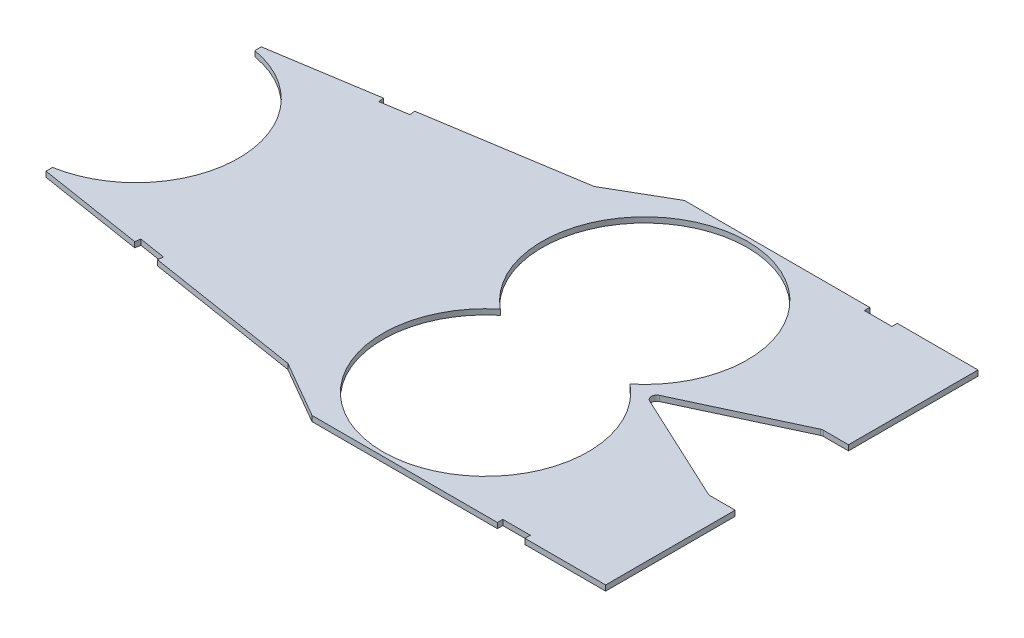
ISO-10303-21;
HEADER;
FILE_DESCRIPTION(('STEP AP214'),'2;1');
FILE_NAME('part.step','',(''),(''),'','','');
FILE_SCHEMA(('AUTOMOTIVE_DESIGN { 1 0 10303 214 1 1 1 1 }'));
ENDSEC;
DATA;
#1=APPLICATION_CONTEXT('core data for automotive mechanical design processes');
#2=APPLICATION_PROTOCOL_DEFINITION('international standard','automotive_design',2000,#1);
#3=PRODUCT_CONTEXT('',#1,'mechanical');
#4=PRODUCT('Part','Part','',(#3));
#5=PRODUCT_RELATED_PRODUCT_CATEGORY('part','',(#4));
#6=PRODUCT_DEFINITION_FORMATION('','',#4);
#7=PRODUCT_DEFINITION_CONTEXT('part definition',#1,'design');
#8=PRODUCT_DEFINITION('design','',#6,#7);
#9=PRODUCT_DEFINITION_SHAPE('','',#8);
#10=(LENGTH_UNIT() NAMED_UNIT(*) SI_UNIT(.MILLI.,.METRE.));
#11=(NAMED_UNIT(*) PLANE_ANGLE_UNIT() SI_UNIT($,.RADIAN.));
#12=(NAMED_UNIT(*) SI_UNIT($,.STERADIAN.) SOLID_ANGLE_UNIT());
#13=UNCERTAINTY_MEASURE_WITH_UNIT(LENGTH_MEASURE(1.E-05),#10,'distance_accuracy_value','');
#14=(GEOMETRIC_REPRESENTATION_CONTEXT(3) GLOBAL_UNCERTAINTY_ASSIGNED_CONTEXT((#13)) GLOBAL_UNIT_ASSIGNED_CONTEXT((#10,
#11,#12)) REPRESENTATION_CONTEXT('',''));
#15=CARTESIAN_POINT('',(0.,0.,0.));
#16=DIRECTION('',(0.,0.,1.));
#17=DIRECTION('',(1.,0.,0.));
#18=AXIS2_PLACEMENT_3D('',#15,#16,#17);
#19=CARTESIAN_POINT('',(-9.3,2.,19.));
#20=DIRECTION('',(0.,1.,0.));
#21=DIRECTION('',(0.,0.,1.));
#22=AXIS2_PLACEMENT_3D('',#19,#20,#21);
#23=CYLINDRICAL_SURFACE('',#22,2.);
#24=CARTESIAN_POINT('',(-9.3,2.,19.));
#25=DIRECTION('',(0.,1.,0.));
#26=DIRECTION('',(0.,0.,1.));
#27=AXIS2_PLACEMENT_3D('',#24,#25,#26);
#28=CIRCLE('',#27,2.);
#29=CARTESIAN_POINT('',(-9.3,2.,21.));
#30=VERTEX_POINT('',#29);
#31=CARTESIAN_POINT('',(-10.1452365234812,2.,20.8126155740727));
#32=VERTEX_POINT('',#31);
#33=EDGE_CURVE('E575',#30,#32,#28,.F.);
#34=ORIENTED_EDGE('',*,*,#33,.F.);
#35=DIRECTION('',(0.,1.,0.));
#36=VECTOR('',#35,1.);
#37=CARTESIAN_POINT('',(-9.3,2.,21.));
#38=LINE('',#37,#36);
#39=CARTESIAN_POINT('',(-9.3,0.,21.));
#40=VERTEX_POINT('',#39);
#41=EDGE_CURVE('E317',#30,#40,#38,.F.);
#42=ORIENTED_EDGE('',*,*,#41,.T.);
#43=CARTESIAN_POINT('',(-9.3,0.,19.));
#44=DIRECTION('',(0.,1.,0.));
#45=DIRECTION('',(0.,0.,1.));
#46=AXIS2_PLACEMENT_3D('',#43,#44,#45);
#47=CIRCLE('',#46,2.);
#48=CARTESIAN_POINT('',(-10.1452365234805,0.,20.8126155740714));
#49=VERTEX_POINT('',#48);
#50=EDGE_CURVE('E19',#49,#40,#47,.T.);
#51=ORIENTED_EDGE('',*,*,#50,.F.);
#52=DIRECTION('',(0.,1.,0.));
#53=VECTOR('',#52,1.);
#54=CARTESIAN_POINT('',(-10.1452365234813,2.,20.8126155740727));
#55=LINE('',#54,#53);
#56=EDGE_CURVE('E315',#49,#32,#55,.T.);
#57=ORIENTED_EDGE('',*,*,#56,.T.);
#58=EDGE_LOOP('',(#34,#42,#51,#57));
#59=FACE_BOUND('',#58,.T.);
#60=ADVANCED_FACE('F16',(#59),#23,.F.);
#61=CARTESIAN_POINT('',(-9.3,2.,-19.));
#62=DIRECTION('',(0.,1.,0.));
#63=DIRECTION('',(0.,0.,1.));
#64=AXIS2_PLACEMENT_3D('',#61,#62,#63);
#65=CYLINDRICAL_SURFACE('',#64,2.);
#66=CARTESIAN_POINT('',(-9.3,2.,-19.));
#67=DIRECTION('',(0.,1.,0.));
#68=DIRECTION('',(0.,0.,1.));
#69=AXIS2_PLACEMENT_3D('',#66,#67,#68);
#70=CIRCLE('',#69,2.);
#71=CARTESIAN_POINT('',(-10.1452365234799,2.,-20.81261557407));
#72=VERTEX_POINT('',#71);
#73=CARTESIAN_POINT('',(-9.3,2.,-21.));
#74=VERTEX_POINT('',#73);
#75=EDGE_CURVE('E284',#72,#74,#70,.F.);
#76=ORIENTED_EDGE('',*,*,#75,.F.);
#77=DIRECTION('',(0.,1.,0.));
#78=VECTOR('',#77,1.);
#79=CARTESIAN_POINT('',(-10.14523652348,2.,-20.81261557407));
#80=LINE('',#79,#78);
#81=CARTESIAN_POINT('',(-10.1452365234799,0.,-20.81261557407));
#82=VERTEX_POINT('',#81);
#83=EDGE_CURVE('E303',#72,#82,#80,.F.);
#84=ORIENTED_EDGE('',*,*,#83,.T.);
#85=CARTESIAN_POINT('',(-9.3,0.,-19.));
#86=DIRECTION('',(0.,1.,0.));
#87=DIRECTION('',(0.,0.,1.));
#88=AXIS2_PLACEMENT_3D('',#85,#86,#87);
#89=CIRCLE('',#88,2.);
#90=CARTESIAN_POINT('',(-9.3,0.,-21.));
#91=VERTEX_POINT('',#90);
#92=EDGE_CURVE('E576',#91,#82,#89,.T.);
#93=ORIENTED_EDGE('',*,*,#92,.F.);
#94=DIRECTION('',(0.,1.,0.));
#95=VECTOR('',#94,1.);
#96=CARTESIAN_POINT('',(-9.3,2.,-21.));
#97=LINE('',#96,#95);
#98=EDGE_CURVE('E288',#91,#74,#97,.T.);
#99=ORIENTED_EDGE('',*,*,#98,.T.);
#100=EDGE_LOOP('',(#76,#84,#93,#99));
#101=FACE_BOUND('',#100,.T.);
#102=ADVANCED_FACE('F584',(#101),#65,.F.);
#103=CARTESIAN_POINT('',(0.,2.,0.));
#104=DIRECTION('',(0.,1.,0.));
#105=DIRECTION('',(0.,0.,1.));
#106=AXIS2_PLACEMENT_3D('',#103,#104,#105);
#107=PLANE('',#106);
#108=CARTESIAN_POINT('',(-84.,2.,-29.5));
#109=DIRECTION('',(0.,1.,0.));
#110=DIRECTION('',(0.,0.,1.));
#111=AXIS2_PLACEMENT_3D('',#108,#109,#110);
#112=CIRCLE('',#111,38.05);
#113=CARTESIAN_POINT('',(-108.032321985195,2.,-1.66880398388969E-12));
#114=VERTEX_POINT('',#113);
#115=CARTESIAN_POINT('',(-59.9676780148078,2.,7.84095011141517E-13));
#116=VERTEX_POINT('',#115);
#117=EDGE_CURVE('E566',#114,#116,#112,.F.);
#118=ORIENTED_EDGE('',*,*,#117,.T.);
#119=CARTESIAN_POINT('',(-84.,2.,29.5));
#120=DIRECTION('',(0.,1.,0.));
#121=DIRECTION('',(0.,0.,1.));
#122=AXIS2_PLACEMENT_3D('',#119,#120,#121);
#123=CIRCLE('',#122,38.05);
#124=EDGE_CURVE('E415',#116,#114,#123,.F.);
#125=ORIENTED_EDGE('',*,*,#124,.T.);
#126=EDGE_LOOP('',(#118,#125));
#127=FACE_BOUND('',#126,.T.);
#128=DIRECTION('',(-0.987688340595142,0.,-0.156434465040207));
#129=VECTOR('',#128,1.);
#130=CARTESIAN_POINT('',(-187.1484049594,2.,45.68382590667));
#131=LINE('',#130,#129);
#132=CARTESIAN_POINT('',(-197.1240571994,2.,44.1038378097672));
#133=VERTEX_POINT('',#132);
#134=CARTESIAN_POINT('',(-187.148404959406,2.,45.683825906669));
#135=VERTEX_POINT('',#134);
#136=EDGE_CURVE('E416',#133,#135,#131,.F.);
#137=ORIENTED_EDGE('',*,*,#136,.T.);
#138=DIRECTION('',(0.156434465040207,0.,-0.987688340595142));
#139=VECTOR('',#138,1.);
#140=CARTESIAN_POINT('',(-187.4612738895,2.,47.65920258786));
#141=LINE('',#140,#139);
#142=CARTESIAN_POINT('',(-187.4612738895,2.,47.659202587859));
#143=VERTEX_POINT('',#142);
#144=EDGE_CURVE('E172',#135,#143,#141,.F.);
#145=ORIENTED_EDGE('',*,*,#144,.T.);
#146=DIRECTION('',(0.987688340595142,0.,0.156434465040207));
#147=VECTOR('',#146,1.);
#148=CARTESIAN_POINT('',(-236.5,2.,39.89223139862));
#149=LINE('',#148,#147);
#150=CARTESIAN_POINT('',(-130.,2.,56.7601742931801));
#151=VERTEX_POINT('',#150);
#152=EDGE_CURVE('E405',#151,#143,#149,.F.);
#153=ORIENTED_EDGE('',*,*,#152,.F.);
#154=DIRECTION('',(0.866025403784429,0.,0.500000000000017));
#155=VECTOR('',#154,1.);
#156=CARTESIAN_POINT('',(-130.,2.,56.76017429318));
#157=LINE('',#156,#155);
#158=CARTESIAN_POINT('',(-108.8,2.,69.0000000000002));
#159=VERTEX_POINT('',#158);
#160=EDGE_CURVE('E395',#159,#151,#157,.F.);
#161=ORIENTED_EDGE('',*,*,#160,.F.);
#162=DIRECTION('',(1.,0.,0.));
#163=VECTOR('',#162,1.);
#164=CARTESIAN_POINT('',(-108.8,2.,69.));
#165=LINE('',#164,#163);
#166=CARTESIAN_POINT('',(-40.1,2.,69.));
#167=VERTEX_POINT('',#166);
#168=EDGE_CURVE('E385',#167,#159,#165,.F.);
#169=ORIENTED_EDGE('',*,*,#168,.F.);
#170=DIRECTION('',(0.,0.,1.));
#171=VECTOR('',#170,1.);
#172=CARTESIAN_POINT('',(-40.1,2.,67.));
#173=LINE('',#172,#171);
#174=CARTESIAN_POINT('',(-40.1,2.,67.));
#175=VERTEX_POINT('',#174);
#176=EDGE_CURVE('E365',#167,#175,#173,.F.);
#177=ORIENTED_EDGE('',*,*,#176,.T.);
#178=DIRECTION('',(-1.,0.,0.));
#179=VECTOR('',#178,1.);
#180=CARTESIAN_POINT('',(-29.9,2.,67.));
#181=LINE('',#180,#179);
#182=CARTESIAN_POINT('',(-29.9,2.,67.));
#183=VERTEX_POINT('',#182);
#184=EDGE_CURVE('E354',#175,#183,#181,.F.);
#185=ORIENTED_EDGE('',*,*,#184,.T.);
#186=DIRECTION('',(0.,0.,-1.));
#187=VECTOR('',#186,1.);
#188=CARTESIAN_POINT('',(-29.9,2.,69.));
#189=LINE('',#188,#187);
#190=CARTESIAN_POINT('',(-29.9,2.,69.));
#191=VERTEX_POINT('',#190);
#192=EDGE_CURVE('E353',#183,#191,#189,.F.);
#193=ORIENTED_EDGE('',*,*,#192,.T.);
#194=DIRECTION('',(1.,0.,0.));
#195=VECTOR('',#194,1.);
#196=CARTESIAN_POINT('',(-108.8,2.,69.));
#197=LINE('',#196,#195);
#198=CARTESIAN_POINT('',(0.,2.,69.));
#199=VERTEX_POINT('',#198);
#200=EDGE_CURVE('E342',#199,#191,#197,.F.);
#201=ORIENTED_EDGE('',*,*,#200,.F.);
#202=DIRECTION('',(0.,0.,-1.));
#203=VECTOR('',#202,1.);
#204=CARTESIAN_POINT('',(0.,2.,69.));
#205=LINE('',#204,#203);
#206=CARTESIAN_POINT('',(0.,2.,21.));
#207=VERTEX_POINT('',#206);
#208=EDGE_CURVE('E332',#207,#199,#205,.F.);
#209=ORIENTED_EDGE('',*,*,#208,.F.);
#210=DIRECTION('',(1.,0.,0.));
#211=VECTOR('',#210,1.);
#212=CARTESIAN_POINT('',(-9.3,2.,21.));
#213=LINE('',#212,#211);
#214=EDGE_CURVE('E319',#207,#30,#213,.F.);
#215=ORIENTED_EDGE('',*,*,#214,.T.);
#216=ORIENTED_EDGE('',*,*,#33,.T.);
#217=DIRECTION('',(0.906307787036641,0.,0.422618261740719));
#218=VECTOR('',#217,1.);
#219=CARTESIAN_POINT('',(-50.89086801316,2.,1.812615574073));
#220=LINE('',#219,#218);
#221=CARTESIAN_POINT('',(-50.8908680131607,2.,1.81261557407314));
#222=VERTEX_POINT('',#221);
#223=EDGE_CURVE('E314',#32,#222,#220,.F.);
#224=ORIENTED_EDGE('',*,*,#223,.T.);
#225=CARTESIAN_POINT('',(-50.04563148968,2.,0.));
#226=DIRECTION('',(0.,1.,0.));
#227=DIRECTION('',(0.,0.,1.));
#228=AXIS2_PLACEMENT_3D('',#225,#226,#227);
#229=CIRCLE('',#228,2.);
#230=CARTESIAN_POINT('',(-50.89086801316,2.,-1.81261557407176));
#231=VERTEX_POINT('',#230);
#232=EDGE_CURVE('E308',#222,#231,#229,.F.);
#233=ORIENTED_EDGE('',*,*,#232,.T.);
#234=DIRECTION('',(-0.906307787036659,0.,0.422618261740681));
#235=VECTOR('',#234,1.);
#236=CARTESIAN_POINT('',(-10.14523652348,2.,-20.81261557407));
#237=LINE('',#236,#235);
#238=EDGE_CURVE('E307',#231,#72,#237,.F.);
#239=ORIENTED_EDGE('',*,*,#238,.T.);
#240=ORIENTED_EDGE('',*,*,#75,.T.);
#241=DIRECTION('',(-1.,0.,0.));
#242=VECTOR('',#241,1.);
#243=CARTESIAN_POINT('',(0.,2.,-21.));
#244=LINE('',#243,#242);
#245=CARTESIAN_POINT('',(0.,2.,-21.));
#246=VERTEX_POINT('',#245);
#247=EDGE_CURVE('E279',#74,#246,#244,.F.);
#248=ORIENTED_EDGE('',*,*,#247,.T.);
#249=DIRECTION('',(0.,0.,-1.));
#250=VECTOR('',#249,1.);
#251=CARTESIAN_POINT('',(0.,2.,69.));
#252=LINE('',#251,#250);
#253=CARTESIAN_POINT('',(0.,2.,-69.));
#254=VERTEX_POINT('',#253);
#255=EDGE_CURVE('E271',#254,#246,#252,.F.);
#256=ORIENTED_EDGE('',*,*,#255,.F.);
#257=DIRECTION('',(-1.,0.,0.));
#258=VECTOR('',#257,1.);
#259=CARTESIAN_POINT('',(0.,2.,-69.));
#260=LINE('',#259,#258);
#261=CARTESIAN_POINT('',(-29.9,2.,-69.));
#262=VERTEX_POINT('',#261);
#263=EDGE_CURVE('E266',#262,#254,#260,.F.);
#264=ORIENTED_EDGE('',*,*,#263,.F.);
#265=DIRECTION('',(0.,0.,-1.));
#266=VECTOR('',#265,1.);
#267=CARTESIAN_POINT('',(-29.9,2.,-67.));
#268=LINE('',#267,#266);
#269=CARTESIAN_POINT('',(-29.9,2.,-67.));
#270=VERTEX_POINT('',#269);
#271=EDGE_CURVE('E512',#262,#270,#268,.F.);
#272=ORIENTED_EDGE('',*,*,#271,.T.);
#273=DIRECTION('',(1.,0.,0.));
#274=VECTOR('',#273,1.);
#275=CARTESIAN_POINT('',(-40.1,2.,-67.));
#276=LINE('',#275,#274);
#277=CARTESIAN_POINT('',(-40.1,2.,-67.));
#278=VERTEX_POINT('',#277);
#279=EDGE_CURVE('E507',#270,#278,#276,.F.);
#280=ORIENTED_EDGE('',*,*,#279,.T.);
#281=DIRECTION('',(0.,0.,1.));
#282=VECTOR('',#281,1.);
#283=CARTESIAN_POINT('',(-40.1,2.,-69.));
#284=LINE('',#283,#282);
#285=CARTESIAN_POINT('',(-40.1,2.,-69.));
#286=VERTEX_POINT('',#285);
#287=EDGE_CURVE('E499',#278,#286,#284,.F.);
#288=ORIENTED_EDGE('',*,*,#287,.T.);
#289=DIRECTION('',(-1.,0.,0.));
#290=VECTOR('',#289,1.);
#291=CARTESIAN_POINT('',(0.,2.,-69.));
#292=LINE('',#291,#290);
#293=CARTESIAN_POINT('',(-108.8,2.,-69.));
#294=VERTEX_POINT('',#293);
#295=EDGE_CURVE('E497',#294,#286,#292,.F.);
#296=ORIENTED_EDGE('',*,*,#295,.F.);
#297=DIRECTION('',(-0.866025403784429,0.,0.500000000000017));
#298=VECTOR('',#297,1.);
#299=CARTESIAN_POINT('',(-108.8,2.,-69.));
#300=LINE('',#299,#298);
#301=CARTESIAN_POINT('',(-130.,2.,-56.7601742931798));
#302=VERTEX_POINT('',#301);
#303=EDGE_CURVE('E492',#302,#294,#300,.F.);
#304=ORIENTED_EDGE('',*,*,#303,.F.);
#305=DIRECTION('',(-0.987688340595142,0.,0.156434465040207));
#306=VECTOR('',#305,1.);
#307=CARTESIAN_POINT('',(-130.,2.,-56.76017429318));
#308=LINE('',#307,#306);
#309=CARTESIAN_POINT('',(-187.461273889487,2.,-47.6592025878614));
#310=VERTEX_POINT('',#309);
#311=EDGE_CURVE('E486',#310,#302,#308,.F.);
#312=ORIENTED_EDGE('',*,*,#311,.F.);
#313=DIRECTION('',(-0.156434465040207,0.,-0.987688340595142));
#314=VECTOR('',#313,1.);
#315=CARTESIAN_POINT('',(-187.1484049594,2.,-45.68382590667));
#316=LINE('',#315,#314);
#317=CARTESIAN_POINT('',(-187.1484049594,2.,-45.6838259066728));
#318=VERTEX_POINT('',#317);
#319=EDGE_CURVE('E481',#310,#318,#316,.F.);
#320=ORIENTED_EDGE('',*,*,#319,.T.);
#321=DIRECTION('',(0.987688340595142,0.,-0.156434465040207));
#322=VECTOR('',#321,1.);
#323=CARTESIAN_POINT('',(-197.1240571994,2.,-44.10383780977));
#324=LINE('',#323,#322);
#325=CARTESIAN_POINT('',(-197.124057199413,2.,-44.103837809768));
#326=VERTEX_POINT('',#325);
#327=EDGE_CURVE('E476',#318,#326,#324,.F.);
#328=ORIENTED_EDGE('',*,*,#327,.T.);
#329=DIRECTION('',(0.156434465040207,0.,0.987688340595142));
#330=VECTOR('',#329,1.);
#331=CARTESIAN_POINT('',(-197.4369261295,2.,-46.07921449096));
#332=LINE('',#331,#330);
#333=CARTESIAN_POINT('',(-197.436926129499,2.,-46.0792144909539));
#334=VERTEX_POINT('',#333);
#335=EDGE_CURVE('E468',#326,#334,#332,.F.);
#336=ORIENTED_EDGE('',*,*,#335,.T.);
#337=DIRECTION('',(-0.987688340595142,0.,0.156434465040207));
#338=VECTOR('',#337,1.);
#339=CARTESIAN_POINT('',(-130.,2.,-56.76017429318));
#340=LINE('',#339,#338);
#341=CARTESIAN_POINT('',(-236.5,2.,-39.8922313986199));
#342=VERTEX_POINT('',#341);
#343=EDGE_CURVE('E466',#342,#334,#340,.F.);
#344=ORIENTED_EDGE('',*,*,#343,.F.);
#345=DIRECTION('',(0.,0.,1.));
#346=VECTOR('',#345,1.);
#347=CARTESIAN_POINT('',(-236.5,2.,-39.89223139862));
#348=LINE('',#347,#346);
#349=CARTESIAN_POINT('',(-236.5,2.,-37.4906988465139));
#350=VERTEX_POINT('',#349);
#351=EDGE_CURVE('E460',#350,#342,#348,.F.);
#352=ORIENTED_EDGE('',*,*,#351,.F.);
#353=CARTESIAN_POINT('',(-243.,2.,0.));
#354=DIRECTION('',(0.,1.,0.));
#355=DIRECTION('',(0.,0.,1.));
#356=AXIS2_PLACEMENT_3D('',#353,#354,#355);
#357=CIRCLE('',#356,38.05);
#358=CARTESIAN_POINT('',(-236.5,2.,37.490698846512));
#359=VERTEX_POINT('',#358);
#360=EDGE_CURVE('E457',#350,#359,#357,.F.);
#361=ORIENTED_EDGE('',*,*,#360,.T.);
#362=DIRECTION('',(0.,0.,1.));
#363=VECTOR('',#362,1.);
#364=CARTESIAN_POINT('',(-236.5,2.,37.49069884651));
#365=LINE('',#364,#363);
#366=CARTESIAN_POINT('',(-236.5,2.,39.89223139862));
#367=VERTEX_POINT('',#366);
#368=EDGE_CURVE('E455',#367,#359,#365,.F.);
#369=ORIENTED_EDGE('',*,*,#368,.F.);
#370=DIRECTION('',(0.987688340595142,0.,0.156434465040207));
#371=VECTOR('',#370,1.);
#372=CARTESIAN_POINT('',(-236.5,2.,39.89223139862));
#373=LINE('',#372,#371);
#374=CARTESIAN_POINT('',(-197.436926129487,2.,46.0792144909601));
#375=VERTEX_POINT('',#374);
#376=EDGE_CURVE('E450',#375,#367,#373,.F.);
#377=ORIENTED_EDGE('',*,*,#376,.F.);
#378=DIRECTION('',(-0.156434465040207,0.,0.987688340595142));
#379=VECTOR('',#378,1.);
#380=CARTESIAN_POINT('',(-197.1240571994,2.,44.10383780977));
#381=LINE('',#380,#379);
#382=EDGE_CURVE('E181',#375,#133,#381,.F.);
#383=ORIENTED_EDGE('',*,*,#382,.T.);
#384=EDGE_LOOP('',(#137,#145,#153,#161,#169,#177,#185,#193,#201,#209,#215,#216,#224,#233,#239,
#240,#248,#256,#264,#272,#280,#288,#296,#304,#312,#320,#328,#336,#344,#352,#361,#369,#377,#383));
#385=FACE_BOUND('',#384,.T.);
#386=ADVANCED_FACE('F282',(#127,#385),#107,.T.);
#387=CARTESIAN_POINT('',(-187.4612738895,2.,47.65920258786));
#388=DIRECTION('',(0.987688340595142,0.,0.156434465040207));
#389=DIRECTION('',(0.156434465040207,0.,-0.987688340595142));
#390=AXIS2_PLACEMENT_3D('',#387,#388,#389);
#391=PLANE('',#390);
#392=ORIENTED_EDGE('',*,*,#144,.F.);
#393=DIRECTION('',(0.,1.,0.));
#394=VECTOR('',#393,1.);
#395=CARTESIAN_POINT('',(-187.1484049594,2.,45.68382590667));
#396=LINE('',#395,#394);
#397=CARTESIAN_POINT('',(-187.1484049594,0.,45.68382590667));
#398=VERTEX_POINT('',#397);
#399=EDGE_CURVE('E413',#135,#398,#396,.F.);
#400=ORIENTED_EDGE('',*,*,#399,.T.);
#401=DIRECTION('',(-0.156434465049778,0.,0.987688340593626));
#402=VECTOR('',#401,1.);
#403=CARTESIAN_POINT('',(-187.1484049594,0.,45.68382590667));
#404=LINE('',#403,#402);
#405=CARTESIAN_POINT('',(-187.4612738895,0.,47.6592025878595));
#406=VERTEX_POINT('',#405);
#407=EDGE_CURVE('E400',#398,#406,#404,.T.);
#408=ORIENTED_EDGE('',*,*,#407,.T.);
#409=DIRECTION('',(0.,1.,0.));
#410=VECTOR('',#409,1.);
#411=CARTESIAN_POINT('',(-187.4612738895,0.,47.6592025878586));
#412=LINE('',#411,#410);
#413=EDGE_CURVE('E403',#143,#406,#412,.F.);
#414=ORIENTED_EDGE('',*,*,#413,.F.);
#415=EDGE_LOOP('',(#392,#400,#408,#414));
#416=FACE_BOUND('',#415,.T.);
#417=ADVANCED_FACE('F786',(#416),#391,.F.);
#418=CARTESIAN_POINT('',(-236.5,0.,39.89223139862));
#419=DIRECTION('',(-0.156434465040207,0.,0.987688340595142));
#420=DIRECTION('',(0.987688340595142,0.,0.156434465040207));
#421=AXIS2_PLACEMENT_3D('',#418,#419,#420);
#422=PLANE('',#421);
#423=ORIENTED_EDGE('',*,*,#152,.T.);
#424=ORIENTED_EDGE('',*,*,#413,.T.);
#425=DIRECTION('',(0.987688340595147,0.,0.156434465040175));
#426=VECTOR('',#425,1.);
#427=CARTESIAN_POINT('',(-187.4612738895,0.,47.65920258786));
#428=LINE('',#427,#426);
#429=CARTESIAN_POINT('',(-130.,0.,56.76017429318));
#430=VERTEX_POINT('',#429);
#431=EDGE_CURVE('E390',#406,#430,#428,.T.);
#432=ORIENTED_EDGE('',*,*,#431,.T.);
#433=DIRECTION('',(0.,1.,0.));
#434=VECTOR('',#433,1.);
#435=CARTESIAN_POINT('',(-130.,0.,56.76017429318));
#436=LINE('',#435,#434);
#437=EDGE_CURVE('E393',#151,#430,#436,.F.);
#438=ORIENTED_EDGE('',*,*,#437,.F.);
#439=EDGE_LOOP('',(#423,#424,#432,#438));
#440=FACE_BOUND('',#439,.T.);
#441=ADVANCED_FACE('F791',(#440),#422,.T.);
#442=CARTESIAN_POINT('',(-130.,0.,56.76017429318));
#443=DIRECTION('',(-0.500000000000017,0.,0.866025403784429));
#444=DIRECTION('',(0.866025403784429,0.,0.500000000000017));
#445=AXIS2_PLACEMENT_3D('',#442,#443,#444);
#446=PLANE('',#445);
#447=ORIENTED_EDGE('',*,*,#437,.T.);
#448=DIRECTION('',(0.86602540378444,0.,0.499999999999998));
#449=VECTOR('',#448,1.);
#450=CARTESIAN_POINT('',(-130.,0.,56.76017429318));
#451=LINE('',#450,#449);
#452=CARTESIAN_POINT('',(-108.8,0.,69.));
#453=VERTEX_POINT('',#452);
#454=EDGE_CURVE('E381',#430,#453,#451,.T.);
#455=ORIENTED_EDGE('',*,*,#454,.T.);
#456=DIRECTION('',(0.,1.,0.));
#457=VECTOR('',#456,1.);
#458=CARTESIAN_POINT('',(-108.8,0.,69.));
#459=LINE('',#458,#457);
#460=EDGE_CURVE('E376',#159,#453,#459,.F.);
#461=ORIENTED_EDGE('',*,*,#460,.F.);
#462=ORIENTED_EDGE('',*,*,#160,.T.);
#463=EDGE_LOOP('',(#447,#455,#461,#462));
#464=FACE_BOUND('',#463,.T.);
#465=ADVANCED_FACE('F793',(#464),#446,.T.);
#466=CARTESIAN_POINT('',(-108.8,0.,69.));
#467=DIRECTION('',(0.,0.,1.));
#468=DIRECTION('',(1.,0.,0.));
#469=AXIS2_PLACEMENT_3D('',#466,#467,#468);
#470=PLANE('',#469);
#471=DIRECTION('',(1.,0.,0.));
#472=VECTOR('',#471,1.);
#473=CARTESIAN_POINT('',(0.,0.,69.));
#474=LINE('',#473,#472);
#475=CARTESIAN_POINT('',(-40.1,0.,69.));
#476=VERTEX_POINT('',#475);
#477=EDGE_CURVE('E370',#453,#476,#474,.T.);
#478=ORIENTED_EDGE('',*,*,#477,.T.);
#479=DIRECTION('',(0.,1.,0.));
#480=VECTOR('',#479,1.);
#481=CARTESIAN_POINT('',(-40.1,2.,69.));
#482=LINE('',#481,#480);
#483=EDGE_CURVE('E373',#476,#167,#482,.T.);
#484=ORIENTED_EDGE('',*,*,#483,.T.);
#485=ORIENTED_EDGE('',*,*,#168,.T.);
#486=ORIENTED_EDGE('',*,*,#460,.T.);
#487=EDGE_LOOP('',(#478,#484,#485,#486));
#488=FACE_BOUND('',#487,.T.);
#489=ADVANCED_FACE('F799',(#488),#470,.T.);
#490=CARTESIAN_POINT('',(-40.1,2.,67.));
#491=DIRECTION('',(-1.,0.,0.));
#492=DIRECTION('',(0.,0.,1.));
#493=AXIS2_PLACEMENT_3D('',#490,#491,#492);
#494=PLANE('',#493);
#495=ORIENTED_EDGE('',*,*,#176,.F.);
#496=ORIENTED_EDGE('',*,*,#483,.F.);
#497=DIRECTION('',(0.,0.,1.));
#498=VECTOR('',#497,1.);
#499=CARTESIAN_POINT('',(-40.1,0.,0.));
#500=LINE('',#499,#498);
#501=CARTESIAN_POINT('',(-40.1,0.,67.));
#502=VERTEX_POINT('',#501);
#503=EDGE_CURVE('E359',#476,#502,#500,.F.);
#504=ORIENTED_EDGE('',*,*,#503,.T.);
#505=DIRECTION('',(0.,1.,0.));
#506=VECTOR('',#505,1.);
#507=CARTESIAN_POINT('',(-40.1,2.,67.));
#508=LINE('',#507,#506);
#509=EDGE_CURVE('E362',#502,#175,#508,.T.);
#510=ORIENTED_EDGE('',*,*,#509,.T.);
#511=EDGE_LOOP('',(#495,#496,#504,#510));
#512=FACE_BOUND('',#511,.T.);
#513=ADVANCED_FACE('F803',(#512),#494,.F.);
#514=CARTESIAN_POINT('',(-29.9,2.,67.));
#515=DIRECTION('',(0.,0.,-1.));
#516=DIRECTION('',(-1.,0.,0.));
#517=AXIS2_PLACEMENT_3D('',#514,#515,#516);
#518=PLANE('',#517);
#519=ORIENTED_EDGE('',*,*,#184,.F.);
#520=ORIENTED_EDGE('',*,*,#509,.F.);
#521=DIRECTION('',(1.,0.,0.));
#522=VECTOR('',#521,1.);
#523=CARTESIAN_POINT('',(0.,0.,67.));
#524=LINE('',#523,#522);
#525=CARTESIAN_POINT('',(-29.9,0.,67.));
#526=VERTEX_POINT('',#525);
#527=EDGE_CURVE('E347',#502,#526,#524,.T.);
#528=ORIENTED_EDGE('',*,*,#527,.T.);
#529=DIRECTION('',(0.,1.,0.));
#530=VECTOR('',#529,1.);
#531=CARTESIAN_POINT('',(-29.9,2.,67.));
#532=LINE('',#531,#530);
#533=EDGE_CURVE('E350',#526,#183,#532,.T.);
#534=ORIENTED_EDGE('',*,*,#533,.T.);
#535=EDGE_LOOP('',(#519,#520,#528,#534));
#536=FACE_BOUND('',#535,.T.);
#537=ADVANCED_FACE('F805',(#536),#518,.F.);
#538=CARTESIAN_POINT('',(-29.9,2.,69.));
#539=DIRECTION('',(1.,0.,0.));
#540=DIRECTION('',(0.,0.,-1.));
#541=AXIS2_PLACEMENT_3D('',#538,#539,#540);
#542=PLANE('',#541);
#543=ORIENTED_EDGE('',*,*,#192,.F.);
#544=ORIENTED_EDGE('',*,*,#533,.F.);
#545=DIRECTION('',(0.,0.,1.));
#546=VECTOR('',#545,1.);
#547=CARTESIAN_POINT('',(-29.9,0.,0.));
#548=LINE('',#547,#546);
#549=CARTESIAN_POINT('',(-29.9,0.,69.));
#550=VERTEX_POINT('',#549);
#551=EDGE_CURVE('E337',#526,#550,#548,.T.);
#552=ORIENTED_EDGE('',*,*,#551,.T.);
#553=DIRECTION('',(0.,1.,0.));
#554=VECTOR('',#553,1.);
#555=CARTESIAN_POINT('',(-29.9,0.,69.));
#556=LINE('',#555,#554);
#557=EDGE_CURVE('E340',#191,#550,#556,.F.);
#558=ORIENTED_EDGE('',*,*,#557,.F.);
#559=EDGE_LOOP('',(#543,#544,#552,#558));
#560=FACE_BOUND('',#559,.T.);
#561=ADVANCED_FACE('F812',(#560),#542,.F.);
#562=CARTESIAN_POINT('',(-108.8,0.,69.));
#563=DIRECTION('',(0.,0.,1.));
#564=DIRECTION('',(1.,0.,0.));
#565=AXIS2_PLACEMENT_3D('',#562,#563,#564);
#566=PLANE('',#565);
#567=ORIENTED_EDGE('',*,*,#200,.T.);
#568=ORIENTED_EDGE('',*,*,#557,.T.);
#569=DIRECTION('',(1.,0.,0.));
#570=VECTOR('',#569,1.);
#571=CARTESIAN_POINT('',(0.,0.,69.));
#572=LINE('',#571,#570);
#573=CARTESIAN_POINT('',(0.,0.,69.));
#574=VERTEX_POINT('',#573);
#575=EDGE_CURVE('E328',#550,#574,#572,.T.);
#576=ORIENTED_EDGE('',*,*,#575,.T.);
#577=DIRECTION('',(0.,1.,0.));
#578=VECTOR('',#577,1.);
#579=CARTESIAN_POINT('',(0.,0.,69.));
#580=LINE('',#579,#578);
#581=EDGE_CURVE('E321',#199,#574,#580,.F.);
#582=ORIENTED_EDGE('',*,*,#581,.F.);
#583=EDGE_LOOP('',(#567,#568,#576,#582));
#584=FACE_BOUND('',#583,.T.);
#585=ADVANCED_FACE('F816',(#584),#566,.T.);
#586=CARTESIAN_POINT('',(0.,0.,69.));
#587=DIRECTION('',(1.,0.,0.));
#588=DIRECTION('',(0.,0.,-1.));
#589=AXIS2_PLACEMENT_3D('',#586,#587,#588);
#590=PLANE('',#589);
#591=DIRECTION('',(0.,0.,1.));
#592=VECTOR('',#591,1.);
#593=CARTESIAN_POINT('',(0.,0.,0.));
#594=LINE('',#593,#592);
#595=CARTESIAN_POINT('',(0.,0.,21.));
#596=VERTEX_POINT('',#595);
#597=EDGE_CURVE('E324',#574,#596,#594,.F.);
#598=ORIENTED_EDGE('',*,*,#597,.T.);
#599=DIRECTION('',(0.,1.,0.));
#600=VECTOR('',#599,1.);
#601=CARTESIAN_POINT('',(0.,2.,21.));
#602=LINE('',#601,#600);
#603=EDGE_CURVE('E114',#596,#207,#602,.T.);
#604=ORIENTED_EDGE('',*,*,#603,.T.);
#605=ORIENTED_EDGE('',*,*,#208,.T.);
#606=ORIENTED_EDGE('',*,*,#581,.T.);
#607=EDGE_LOOP('',(#598,#604,#605,#606));
#608=FACE_BOUND('',#607,.T.);
#609=ADVANCED_FACE('F818',(#608),#590,.T.);
#610=CARTESIAN_POINT('',(-9.3,2.,21.));
#611=DIRECTION('',(0.,0.,1.));
#612=DIRECTION('',(1.,0.,0.));
#613=AXIS2_PLACEMENT_3D('',#610,#611,#612);
#614=PLANE('',#613);
#615=ORIENTED_EDGE('',*,*,#214,.F.);
#616=ORIENTED_EDGE('',*,*,#603,.F.);
#617=DIRECTION('',(1.,0.,0.));
#618=VECTOR('',#617,1.);
#619=CARTESIAN_POINT('',(0.,0.,21.));
#620=LINE('',#619,#618);
#621=EDGE_CURVE('E327',#596,#40,#620,.F.);
#622=ORIENTED_EDGE('',*,*,#621,.T.);
#623=ORIENTED_EDGE('',*,*,#41,.F.);
#624=EDGE_LOOP('',(#615,#616,#622,#623));
#625=FACE_BOUND('',#624,.T.);
#626=ADVANCED_FACE('F820',(#625),#614,.F.);
#627=CARTESIAN_POINT('',(-50.89086801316,2.,1.812615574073));
#628=DIRECTION('',(-0.422618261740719,0.,0.906307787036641));
#629=DIRECTION('',(0.906307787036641,0.,0.422618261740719));
#630=AXIS2_PLACEMENT_3D('',#627,#628,#629);
#631=PLANE('',#630);
#632=ORIENTED_EDGE('',*,*,#223,.F.);
#633=ORIENTED_EDGE('',*,*,#56,.F.);
#634=DIRECTION('',(-0.906307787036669,0.,-0.422618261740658));
#635=VECTOR('',#634,1.);
#636=CARTESIAN_POINT('',(-10.14523652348,0.,20.81261557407));
#637=LINE('',#636,#635);
#638=CARTESIAN_POINT('',(-50.8908680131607,0.,1.81261557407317));
#639=VERTEX_POINT('',#638);
#640=EDGE_CURVE('E565',#49,#639,#637,.T.);
#641=ORIENTED_EDGE('',*,*,#640,.T.);
#642=DIRECTION('',(0.,1.,0.));
#643=VECTOR('',#642,1.);
#644=CARTESIAN_POINT('',(-50.8908680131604,2.,1.81261557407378));
#645=LINE('',#644,#643);
#646=EDGE_CURVE('E311',#639,#222,#645,.T.);
#647=ORIENTED_EDGE('',*,*,#646,.T.);
#648=EDGE_LOOP('',(#632,#633,#641,#647));
#649=FACE_BOUND('',#648,.T.);
#650=ADVANCED_FACE('F824',(#649),#631,.F.);
#651=CARTESIAN_POINT('',(-50.04563148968,2.,0.));
#652=DIRECTION('',(0.,1.,0.));
#653=DIRECTION('',(0.,0.,1.));
#654=AXIS2_PLACEMENT_3D('',#651,#652,#653);
#655=CYLINDRICAL_SURFACE('',#654,2.);
#656=ORIENTED_EDGE('',*,*,#232,.F.);
#657=ORIENTED_EDGE('',*,*,#646,.F.);
#658=CARTESIAN_POINT('',(-50.04563148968,0.,0.));
#659=DIRECTION('',(0.,1.,0.));
#660=DIRECTION('',(0.,0.,1.));
#661=AXIS2_PLACEMENT_3D('',#658,#659,#660);
#662=CIRCLE('',#661,2.);
#663=CARTESIAN_POINT('',(-50.8908680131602,0.,-1.81261557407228));
#664=VERTEX_POINT('',#663);
#665=EDGE_CURVE('E561',#639,#664,#662,.F.);
#666=ORIENTED_EDGE('',*,*,#665,.T.);
#667=DIRECTION('',(0.,1.,0.));
#668=VECTOR('',#667,1.);
#669=CARTESIAN_POINT('',(-50.8908680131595,2.,-1.81261557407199));
#670=LINE('',#669,#668);
#671=EDGE_CURVE('E304',#664,#231,#670,.T.);
#672=ORIENTED_EDGE('',*,*,#671,.T.);
#673=EDGE_LOOP('',(#656,#657,#666,#672));
#674=FACE_BOUND('',#673,.T.);
#675=ADVANCED_FACE('F883',(#674),#655,.F.);
#676=CARTESIAN_POINT('',(-10.14523652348,2.,-20.81261557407));
#677=DIRECTION('',(-0.422618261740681,0.,-0.906307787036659));
#678=DIRECTION('',(-0.906307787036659,0.,0.422618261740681));
#679=AXIS2_PLACEMENT_3D('',#676,#677,#678);
#680=PLANE('',#679);
#681=ORIENTED_EDGE('',*,*,#238,.F.);
#682=ORIENTED_EDGE('',*,*,#671,.F.);
#683=DIRECTION('',(0.906307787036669,0.,-0.422618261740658));
#684=VECTOR('',#683,1.);
#685=CARTESIAN_POINT('',(-50.89086801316,0.,-1.812615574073));
#686=LINE('',#685,#684);
#687=EDGE_CURVE('E564',#664,#82,#686,.T.);
#688=ORIENTED_EDGE('',*,*,#687,.T.);
#689=ORIENTED_EDGE('',*,*,#83,.F.);
#690=EDGE_LOOP('',(#681,#682,#688,#689));
#691=FACE_BOUND('',#690,.T.);
#692=ADVANCED_FACE('F587',(#691),#680,.F.);
#693=CARTESIAN_POINT('',(0.,2.,-21.));
#694=DIRECTION('',(0.,0.,-1.));
#695=DIRECTION('',(-1.,0.,0.));
#696=AXIS2_PLACEMENT_3D('',#693,#694,#695);
#697=PLANE('',#696);
#698=ORIENTED_EDGE('',*,*,#247,.F.);
#699=ORIENTED_EDGE('',*,*,#98,.F.);
#700=DIRECTION('',(1.,0.,0.));
#701=VECTOR('',#700,1.);
#702=CARTESIAN_POINT('',(0.,0.,-21.));
#703=LINE('',#702,#701);
#704=CARTESIAN_POINT('',(0.,0.,-21.));
#705=VERTEX_POINT('',#704);
#706=EDGE_CURVE('E293',#91,#705,#703,.T.);
#707=ORIENTED_EDGE('',*,*,#706,.T.);
#708=DIRECTION('',(0.,1.,0.));
#709=VECTOR('',#708,1.);
#710=CARTESIAN_POINT('',(0.,0.,-21.));
#711=LINE('',#710,#709);
#712=EDGE_CURVE('E276',#246,#705,#711,.F.);
#713=ORIENTED_EDGE('',*,*,#712,.F.);
#714=EDGE_LOOP('',(#698,#699,#707,#713));
#715=FACE_BOUND('',#714,.T.);
#716=ADVANCED_FACE('F291',(#715),#697,.F.);
#717=CARTESIAN_POINT('',(0.,0.,69.));
#718=DIRECTION('',(1.,0.,0.));
#719=DIRECTION('',(0.,0.,-1.));
#720=AXIS2_PLACEMENT_3D('',#717,#718,#719);
#721=PLANE('',#720);
#722=ORIENTED_EDGE('',*,*,#255,.T.);
#723=ORIENTED_EDGE('',*,*,#712,.T.);
#724=DIRECTION('',(0.,0.,1.));
#725=VECTOR('',#724,1.);
#726=CARTESIAN_POINT('',(0.,0.,0.));
#727=LINE('',#726,#725);
#728=CARTESIAN_POINT('',(0.,0.,-69.));
#729=VERTEX_POINT('',#728);
#730=EDGE_CURVE('E589',#705,#729,#727,.F.);
#731=ORIENTED_EDGE('',*,*,#730,.T.);
#732=DIRECTION('',(0.,1.,0.));
#733=VECTOR('',#732,1.);
#734=CARTESIAN_POINT('',(0.,0.,-69.));
#735=LINE('',#734,#733);
#736=EDGE_CURVE('E278',#254,#729,#735,.F.);
#737=ORIENTED_EDGE('',*,*,#736,.F.);
#738=EDGE_LOOP('',(#722,#723,#731,#737));
#739=FACE_BOUND('',#738,.T.);
#740=ADVANCED_FACE('F273',(#739),#721,.T.);
#741=CARTESIAN_POINT('',(0.,0.,-69.));
#742=DIRECTION('',(0.,0.,-1.));
#743=DIRECTION('',(-1.,0.,0.));
#744=AXIS2_PLACEMENT_3D('',#741,#742,#743);
#745=PLANE('',#744);
#746=DIRECTION('',(1.,0.,0.));
#747=VECTOR('',#746,1.);
#748=CARTESIAN_POINT('',(0.,0.,-69.));
#749=LINE('',#748,#747);
#750=CARTESIAN_POINT('',(-29.9,0.,-69.));
#751=VERTEX_POINT('',#750);
#752=EDGE_CURVE('E695',#729,#751,#749,.F.);
#753=ORIENTED_EDGE('',*,*,#752,.T.);
#754=DIRECTION('',(0.,1.,0.));
#755=VECTOR('',#754,1.);
#756=CARTESIAN_POINT('',(-29.9,2.,-69.));
#757=LINE('',#756,#755);
#758=EDGE_CURVE('E514',#751,#262,#757,.T.);
#759=ORIENTED_EDGE('',*,*,#758,.T.);
#760=ORIENTED_EDGE('',*,*,#263,.T.);
#761=ORIENTED_EDGE('',*,*,#736,.T.);
#762=EDGE_LOOP('',(#753,#759,#760,#761));
#763=FACE_BOUND('',#762,.T.);
#764=ADVANCED_FACE('F710',(#763),#745,.T.);
#765=CARTESIAN_POINT('',(-29.9,2.,-67.));
#766=DIRECTION('',(1.,0.,0.));
#767=DIRECTION('',(0.,0.,-1.));
#768=AXIS2_PLACEMENT_3D('',#765,#766,#767);
#769=PLANE('',#768);
#770=ORIENTED_EDGE('',*,*,#271,.F.);
#771=ORIENTED_EDGE('',*,*,#758,.F.);
#772=DIRECTION('',(0.,0.,1.));
#773=VECTOR('',#772,1.);
#774=CARTESIAN_POINT('',(-29.9,0.,0.));
#775=LINE('',#774,#773);
#776=CARTESIAN_POINT('',(-29.9,0.,-67.));
#777=VERTEX_POINT('',#776);
#778=EDGE_CURVE('E686',#751,#777,#775,.T.);
#779=ORIENTED_EDGE('',*,*,#778,.T.);
#780=DIRECTION('',(0.,1.,0.));
#781=VECTOR('',#780,1.);
#782=CARTESIAN_POINT('',(-29.9,2.,-67.));
#783=LINE('',#782,#781);
#784=EDGE_CURVE('E509',#777,#270,#783,.T.);
#785=ORIENTED_EDGE('',*,*,#784,.T.);
#786=EDGE_LOOP('',(#770,#771,#779,#785));
#787=FACE_BOUND('',#786,.T.);
#788=ADVANCED_FACE('F713',(#787),#769,.F.);
#789=CARTESIAN_POINT('',(-40.1,2.,-67.));
#790=DIRECTION('',(0.,0.,1.));
#791=DIRECTION('',(1.,0.,0.));
#792=AXIS2_PLACEMENT_3D('',#789,#790,#791);
#793=PLANE('',#792);
#794=ORIENTED_EDGE('',*,*,#279,.F.);
#795=ORIENTED_EDGE('',*,*,#784,.F.);
#796=DIRECTION('',(1.,0.,0.));
#797=VECTOR('',#796,1.);
#798=CARTESIAN_POINT('',(0.,0.,-67.));
#799=LINE('',#798,#797);
#800=CARTESIAN_POINT('',(-40.1,0.,-67.));
#801=VERTEX_POINT('',#800);
#802=EDGE_CURVE('E677',#777,#801,#799,.F.);
#803=ORIENTED_EDGE('',*,*,#802,.T.);
#804=DIRECTION('',(0.,1.,0.));
#805=VECTOR('',#804,1.);
#806=CARTESIAN_POINT('',(-40.1,2.,-67.));
#807=LINE('',#806,#805);
#808=EDGE_CURVE('E504',#801,#278,#807,.T.);
#809=ORIENTED_EDGE('',*,*,#808,.T.);
#810=EDGE_LOOP('',(#794,#795,#803,#809));
#811=FACE_BOUND('',#810,.T.);
#812=ADVANCED_FACE('F717',(#811),#793,.F.);
#813=CARTESIAN_POINT('',(-40.1,2.,-69.));
#814=DIRECTION('',(-1.,0.,0.));
#815=DIRECTION('',(0.,0.,1.));
#816=AXIS2_PLACEMENT_3D('',#813,#814,#815);
#817=PLANE('',#816);
#818=ORIENTED_EDGE('',*,*,#287,.F.);
#819=ORIENTED_EDGE('',*,*,#808,.F.);
#820=DIRECTION('',(0.,0.,1.));
#821=VECTOR('',#820,1.);
#822=CARTESIAN_POINT('',(-40.1,0.,0.));
#823=LINE('',#822,#821);
#824=CARTESIAN_POINT('',(-40.1,0.,-69.));
#825=VERTEX_POINT('',#824);
#826=EDGE_CURVE('E669',#801,#825,#823,.F.);
#827=ORIENTED_EDGE('',*,*,#826,.T.);
#828=DIRECTION('',(0.,1.,0.));
#829=VECTOR('',#828,1.);
#830=CARTESIAN_POINT('',(-40.1,0.,-69.));
#831=LINE('',#830,#829);
#832=EDGE_CURVE('E494',#286,#825,#831,.F.);
#833=ORIENTED_EDGE('',*,*,#832,.F.);
#834=EDGE_LOOP('',(#818,#819,#827,#833));
#835=FACE_BOUND('',#834,.T.);
#836=ADVANCED_FACE('F720',(#835),#817,.F.);
#837=CARTESIAN_POINT('',(0.,0.,-69.));
#838=DIRECTION('',(0.,0.,-1.));
#839=DIRECTION('',(-1.,0.,0.));
#840=AXIS2_PLACEMENT_3D('',#837,#838,#839);
#841=PLANE('',#840);
#842=ORIENTED_EDGE('',*,*,#295,.T.);
#843=ORIENTED_EDGE('',*,*,#832,.T.);
#844=DIRECTION('',(1.,0.,0.));
#845=VECTOR('',#844,1.);
#846=CARTESIAN_POINT('',(0.,0.,-69.));
#847=LINE('',#846,#845);
#848=CARTESIAN_POINT('',(-108.8,0.,-69.));
#849=VERTEX_POINT('',#848);
#850=EDGE_CURVE('E661',#825,#849,#847,.F.);
#851=ORIENTED_EDGE('',*,*,#850,.T.);
#852=DIRECTION('',(0.,1.,0.));
#853=VECTOR('',#852,1.);
#854=CARTESIAN_POINT('',(-108.8,0.,-69.));
#855=LINE('',#854,#853);
#856=EDGE_CURVE('E489',#294,#849,#855,.F.);
#857=ORIENTED_EDGE('',*,*,#856,.F.);
#858=EDGE_LOOP('',(#842,#843,#851,#857));
#859=FACE_BOUND('',#858,.T.);
#860=ADVANCED_FACE('F727',(#859),#841,.T.);
#861=CARTESIAN_POINT('',(-108.8,0.,-69.));
#862=DIRECTION('',(-0.500000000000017,0.,-0.866025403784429));
#863=DIRECTION('',(-0.866025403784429,0.,0.500000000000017));
#864=AXIS2_PLACEMENT_3D('',#861,#862,#863);
#865=PLANE('',#864);
#866=ORIENTED_EDGE('',*,*,#856,.T.);
#867=DIRECTION('',(-0.86602540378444,0.,0.499999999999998));
#868=VECTOR('',#867,1.);
#869=CARTESIAN_POINT('',(-108.8,0.,-69.));
#870=LINE('',#869,#868);
#871=CARTESIAN_POINT('',(-130.,0.,-56.76017429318));
#872=VERTEX_POINT('',#871);
#873=EDGE_CURVE('E653',#849,#872,#870,.T.);
#874=ORIENTED_EDGE('',*,*,#873,.T.);
#875=DIRECTION('',(0.,1.,0.));
#876=VECTOR('',#875,1.);
#877=CARTESIAN_POINT('',(-130.,0.,-56.76017429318));
#878=LINE('',#877,#876);
#879=EDGE_CURVE('E488',#302,#872,#878,.F.);
#880=ORIENTED_EDGE('',*,*,#879,.F.);
#881=ORIENTED_EDGE('',*,*,#303,.T.);
#882=EDGE_LOOP('',(#866,#874,#880,#881));
#883=FACE_BOUND('',#882,.T.);
#884=ADVANCED_FACE('F733',(#883),#865,.T.);
#885=CARTESIAN_POINT('',(-130.,0.,-56.76017429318));
#886=DIRECTION('',(-0.156434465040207,0.,-0.987688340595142));
#887=DIRECTION('',(-0.987688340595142,0.,0.156434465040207));
#888=AXIS2_PLACEMENT_3D('',#885,#886,#887);
#889=PLANE('',#888);
#890=DIRECTION('',(-0.987688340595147,0.,0.156434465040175));
#891=VECTOR('',#890,1.);
#892=CARTESIAN_POINT('',(-130.,0.,-56.76017429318));
#893=LINE('',#892,#891);
#894=CARTESIAN_POINT('',(-187.461273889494,0.,-47.659202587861));
#895=VERTEX_POINT('',#894);
#896=EDGE_CURVE('E644',#872,#895,#893,.T.);
#897=ORIENTED_EDGE('',*,*,#896,.T.);
#898=DIRECTION('',(0.,1.,0.));
#899=VECTOR('',#898,1.);
#900=CARTESIAN_POINT('',(-187.461273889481,2.,-47.659202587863));
#901=LINE('',#900,#899);
#902=EDGE_CURVE('E483',#895,#310,#901,.T.);
#903=ORIENTED_EDGE('',*,*,#902,.T.);
#904=ORIENTED_EDGE('',*,*,#311,.T.);
#905=ORIENTED_EDGE('',*,*,#879,.T.);
#906=EDGE_LOOP('',(#897,#903,#904,#905));
#907=FACE_BOUND('',#906,.T.);
#908=ADVANCED_FACE('F735',(#907),#889,.T.);
#909=CARTESIAN_POINT('',(-187.1484049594,2.,-45.68382590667));
#910=DIRECTION('',(0.987688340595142,0.,-0.156434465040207));
#911=DIRECTION('',(-0.156434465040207,0.,-0.987688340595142));
#912=AXIS2_PLACEMENT_3D('',#909,#910,#911);
#913=PLANE('',#912);
#914=ORIENTED_EDGE('',*,*,#319,.F.);
#915=ORIENTED_EDGE('',*,*,#902,.F.);
#916=DIRECTION('',(0.156434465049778,0.,0.987688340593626));
#917=VECTOR('',#916,1.);
#918=CARTESIAN_POINT('',(-187.4612738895,0.,-47.65920258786));
#919=LINE('',#918,#917);
#920=CARTESIAN_POINT('',(-187.1484049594,0.,-45.6838259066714));
#921=VERTEX_POINT('',#920);
#922=EDGE_CURVE('E635',#895,#921,#919,.T.);
#923=ORIENTED_EDGE('',*,*,#922,.T.);
#924=DIRECTION('',(0.,1.,0.));
#925=VECTOR('',#924,1.);
#926=CARTESIAN_POINT('',(-187.148404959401,2.,-45.6838259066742));
#927=LINE('',#926,#925);
#928=EDGE_CURVE('E478',#921,#318,#927,.T.);
#929=ORIENTED_EDGE('',*,*,#928,.T.);
#930=EDGE_LOOP('',(#914,#915,#923,#929));
#931=FACE_BOUND('',#930,.T.);
#932=ADVANCED_FACE('F740',(#931),#913,.F.);
#933=CARTESIAN_POINT('',(-197.1240571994,2.,-44.10383780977));
#934=DIRECTION('',(0.156434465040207,0.,0.987688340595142));
#935=DIRECTION('',(0.987688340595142,0.,-0.156434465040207));
#936=AXIS2_PLACEMENT_3D('',#933,#934,#935);
#937=PLANE('',#936);
#938=ORIENTED_EDGE('',*,*,#327,.F.);
#939=ORIENTED_EDGE('',*,*,#928,.F.);
#940=DIRECTION('',(-0.987688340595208,0.,0.156434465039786));
#941=VECTOR('',#940,1.);
#942=CARTESIAN_POINT('',(-187.1484049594,0.,-45.68382590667));
#943=LINE('',#942,#941);
#944=CARTESIAN_POINT('',(-197.124057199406,0.,-44.103837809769));
#945=VERTEX_POINT('',#944);
#946=EDGE_CURVE('E626',#921,#945,#943,.T.);
#947=ORIENTED_EDGE('',*,*,#946,.T.);
#948=DIRECTION('',(0.,1.,0.));
#949=VECTOR('',#948,1.);
#950=CARTESIAN_POINT('',(-197.124057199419,2.,-44.103837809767));
#951=LINE('',#950,#949);
#952=EDGE_CURVE('E473',#945,#326,#951,.T.);
#953=ORIENTED_EDGE('',*,*,#952,.T.);
#954=EDGE_LOOP('',(#938,#939,#947,#953));
#955=FACE_BOUND('',#954,.T.);
#956=ADVANCED_FACE('F744',(#955),#937,.F.);
#957=CARTESIAN_POINT('',(-197.4369261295,2.,-46.07921449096));
#958=DIRECTION('',(-0.987688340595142,0.,0.156434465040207));
#959=DIRECTION('',(0.156434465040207,0.,0.987688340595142));
#960=AXIS2_PLACEMENT_3D('',#957,#958,#959);
#961=PLANE('',#960);
#962=ORIENTED_EDGE('',*,*,#335,.F.);
#963=ORIENTED_EDGE('',*,*,#952,.F.);
#964=DIRECTION('',(-0.156434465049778,0.,-0.987688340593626));
#965=VECTOR('',#964,1.);
#966=CARTESIAN_POINT('',(-197.1240571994,0.,-44.10383780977));
#967=LINE('',#966,#965);
#968=CARTESIAN_POINT('',(-197.4369261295,0.,-46.079214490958));
#969=VERTEX_POINT('',#968);
#970=EDGE_CURVE('E618',#945,#969,#967,.T.);
#971=ORIENTED_EDGE('',*,*,#970,.T.);
#972=DIRECTION('',(0.,1.,0.));
#973=VECTOR('',#972,1.);
#974=CARTESIAN_POINT('',(-197.436926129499,0.,-46.0792144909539));
#975=LINE('',#974,#973);
#976=EDGE_CURVE('E463',#334,#969,#975,.F.);
#977=ORIENTED_EDGE('',*,*,#976,.F.);
#978=EDGE_LOOP('',(#962,#963,#971,#977));
#979=FACE_BOUND('',#978,.T.);
#980=ADVANCED_FACE('F746',(#979),#961,.F.);
#981=CARTESIAN_POINT('',(-130.,0.,-56.76017429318));
#982=DIRECTION('',(-0.156434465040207,0.,-0.987688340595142));
#983=DIRECTION('',(-0.987688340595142,0.,0.156434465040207));
#984=AXIS2_PLACEMENT_3D('',#981,#982,#983);
#985=PLANE('',#984);
#986=ORIENTED_EDGE('',*,*,#343,.T.);
#987=ORIENTED_EDGE('',*,*,#976,.T.);
#988=DIRECTION('',(-0.987688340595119,0.,0.15643446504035));
#989=VECTOR('',#988,1.);
#990=CARTESIAN_POINT('',(-197.4369261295,0.,-46.07921449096));
#991=LINE('',#990,#989);
#992=CARTESIAN_POINT('',(-236.5,0.,-39.89223139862));
#993=VERTEX_POINT('',#992);
#994=EDGE_CURVE('E615',#969,#993,#991,.T.);
#995=ORIENTED_EDGE('',*,*,#994,.T.);
#996=DIRECTION('',(0.,1.,0.));
#997=VECTOR('',#996,1.);
#998=CARTESIAN_POINT('',(-236.5,0.,-39.89223139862));
#999=LINE('',#998,#997);
#1000=EDGE_CURVE('E462',#342,#993,#999,.F.);
#1001=ORIENTED_EDGE('',*,*,#1000,.F.);
#1002=EDGE_LOOP('',(#986,#987,#995,#1001));
#1003=FACE_BOUND('',#1002,.T.);
#1004=ADVANCED_FACE('F754',(#1003),#985,.T.);
#1005=CARTESIAN_POINT('',(-236.5,0.,-39.89223139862));
#1006=DIRECTION('',(-1.,0.,0.));
#1007=DIRECTION('',(0.,0.,1.));
#1008=AXIS2_PLACEMENT_3D('',#1005,#1006,#1007);
#1009=PLANE('',#1008);
#1010=ORIENTED_EDGE('',*,*,#1000,.T.);
#1011=DIRECTION('',(0.,0.,1.));
#1012=VECTOR('',#1011,1.);
#1013=CARTESIAN_POINT('',(-236.5,0.,0.));
#1014=LINE('',#1013,#1012);
#1015=CARTESIAN_POINT('',(-236.5,0.,-37.4906988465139));
#1016=VERTEX_POINT('',#1015);
#1017=EDGE_CURVE('E560',#993,#1016,#1014,.T.);
#1018=ORIENTED_EDGE('',*,*,#1017,.T.);
#1019=DIRECTION('',(0.,1.,0.));
#1020=VECTOR('',#1019,1.);
#1021=CARTESIAN_POINT('',(-236.499999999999,0.,-37.4906988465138));
#1022=LINE('',#1021,#1020);
#1023=EDGE_CURVE('E572',#1016,#350,#1022,.T.);
#1024=ORIENTED_EDGE('',*,*,#1023,.T.);
#1025=ORIENTED_EDGE('',*,*,#351,.T.);
#1026=EDGE_LOOP('',(#1010,#1018,#1024,#1025));
#1027=FACE_BOUND('',#1026,.T.);
#1028=ADVANCED_FACE('F762',(#1027),#1009,.T.);
#1029=CARTESIAN_POINT('',(-243.,0.,0.));
#1030=DIRECTION('',(0.,1.,0.));
#1031=DIRECTION('',(0.,0.,1.));
#1032=AXIS2_PLACEMENT_3D('',#1029,#1030,#1031);
#1033=CYLINDRICAL_SURFACE('',#1032,38.05);
#1034=ORIENTED_EDGE('',*,*,#360,.F.);
#1035=ORIENTED_EDGE('',*,*,#1023,.F.);
#1036=CARTESIAN_POINT('',(-243.,0.,0.));
#1037=DIRECTION('',(0.,1.,0.));
#1038=DIRECTION('',(0.,0.,1.));
#1039=AXIS2_PLACEMENT_3D('',#1036,#1037,#1038);
#1040=CIRCLE('',#1039,38.05);
#1041=CARTESIAN_POINT('',(-236.5,0.,37.490698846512));
#1042=VERTEX_POINT('',#1041);
#1043=EDGE_CURVE('E556',#1016,#1042,#1040,.F.);
#1044=ORIENTED_EDGE('',*,*,#1043,.T.);
#1045=DIRECTION('',(0.,1.,0.));
#1046=VECTOR('',#1045,1.);
#1047=CARTESIAN_POINT('',(-236.5,0.,37.49069884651));
#1048=LINE('',#1047,#1046);
#1049=EDGE_CURVE('E452',#359,#1042,#1048,.F.);
#1050=ORIENTED_EDGE('',*,*,#1049,.F.);
#1051=EDGE_LOOP('',(#1034,#1035,#1044,#1050));
#1052=FACE_BOUND('',#1051,.T.);
#1053=ADVANCED_FACE('F761',(#1052),#1033,.F.);
#1054=CARTESIAN_POINT('',(-236.5,0.,37.49069884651));
#1055=DIRECTION('',(-1.,0.,0.));
#1056=DIRECTION('',(0.,0.,1.));
#1057=AXIS2_PLACEMENT_3D('',#1054,#1055,#1056);
#1058=PLANE('',#1057);
#1059=ORIENTED_EDGE('',*,*,#1049,.T.);
#1060=DIRECTION('',(0.,0.,1.));
#1061=VECTOR('',#1060,1.);
#1062=CARTESIAN_POINT('',(-236.5,0.,0.));
#1063=LINE('',#1062,#1061);
#1064=CARTESIAN_POINT('',(-236.5,0.,39.89223139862));
#1065=VERTEX_POINT('',#1064);
#1066=EDGE_CURVE('E559',#1042,#1065,#1063,.T.);
#1067=ORIENTED_EDGE('',*,*,#1066,.T.);
#1068=DIRECTION('',(0.,1.,0.));
#1069=VECTOR('',#1068,1.);
#1070=CARTESIAN_POINT('',(-236.5,0.,39.89223139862));
#1071=LINE('',#1070,#1069);
#1072=EDGE_CURVE('E447',#367,#1065,#1071,.F.);
#1073=ORIENTED_EDGE('',*,*,#1072,.F.);
#1074=ORIENTED_EDGE('',*,*,#368,.T.);
#1075=EDGE_LOOP('',(#1059,#1067,#1073,#1074));
#1076=FACE_BOUND('',#1075,.T.);
#1077=ADVANCED_FACE('F773',(#1076),#1058,.T.);
#1078=CARTESIAN_POINT('',(-236.5,0.,39.89223139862));
#1079=DIRECTION('',(-0.156434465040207,0.,0.987688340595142));
#1080=DIRECTION('',(0.987688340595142,0.,0.156434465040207));
#1081=AXIS2_PLACEMENT_3D('',#1078,#1079,#1080);
#1082=PLANE('',#1081);
#1083=DIRECTION('',(0.987688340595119,0.,0.15643446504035));
#1084=VECTOR('',#1083,1.);
#1085=CARTESIAN_POINT('',(-236.5,0.,39.89223139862));
#1086=LINE('',#1085,#1084);
#1087=CARTESIAN_POINT('',(-197.436926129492,0.,46.0792144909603));
#1088=VERTEX_POINT('',#1087);
#1089=EDGE_CURVE('E442',#1065,#1088,#1086,.T.);
#1090=ORIENTED_EDGE('',*,*,#1089,.T.);
#1091=DIRECTION('',(0.,1.,0.));
#1092=VECTOR('',#1091,1.);
#1093=CARTESIAN_POINT('',(-197.436926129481,2.,46.079214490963));
#1094=LINE('',#1093,#1092);
#1095=EDGE_CURVE('E437',#1088,#375,#1094,.T.);
#1096=ORIENTED_EDGE('',*,*,#1095,.T.);
#1097=ORIENTED_EDGE('',*,*,#376,.T.);
#1098=ORIENTED_EDGE('',*,*,#1072,.T.);
#1099=EDGE_LOOP('',(#1090,#1096,#1097,#1098));
#1100=FACE_BOUND('',#1099,.T.);
#1101=ADVANCED_FACE('F777',(#1100),#1082,.T.);
#1102=CARTESIAN_POINT('',(-197.1240571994,2.,44.10383780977));
#1103=DIRECTION('',(-0.987688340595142,0.,-0.156434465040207));
#1104=DIRECTION('',(-0.156434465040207,0.,0.987688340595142));
#1105=AXIS2_PLACEMENT_3D('',#1102,#1103,#1104);
#1106=PLANE('',#1105);
#1107=ORIENTED_EDGE('',*,*,#382,.F.);
#1108=ORIENTED_EDGE('',*,*,#1095,.F.);
#1109=DIRECTION('',(0.156434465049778,0.,-0.987688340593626));
#1110=VECTOR('',#1109,1.);
#1111=CARTESIAN_POINT('',(-197.4369261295,0.,46.07921449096));
#1112=LINE('',#1111,#1110);
#1113=CARTESIAN_POINT('',(-197.1240571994,0.,44.1038378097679));
#1114=VERTEX_POINT('',#1113);
#1115=EDGE_CURVE('E422',#1088,#1114,#1112,.T.);
#1116=ORIENTED_EDGE('',*,*,#1115,.T.);
#1117=DIRECTION('',(0.,1.,0.));
#1118=VECTOR('',#1117,1.);
#1119=CARTESIAN_POINT('',(-197.124057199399,2.,44.1038378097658));
#1120=LINE('',#1119,#1118);
#1121=EDGE_CURVE('E429',#1114,#133,#1120,.T.);
#1122=ORIENTED_EDGE('',*,*,#1121,.T.);
#1123=EDGE_LOOP('',(#1107,#1108,#1116,#1122));
#1124=FACE_BOUND('',#1123,.T.);
#1125=ADVANCED_FACE('F779',(#1124),#1106,.F.);
#1126=CARTESIAN_POINT('',(-187.1484049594,2.,45.68382590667));
#1127=DIRECTION('',(0.156434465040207,0.,-0.987688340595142));
#1128=DIRECTION('',(-0.987688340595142,0.,-0.156434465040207));
#1129=AXIS2_PLACEMENT_3D('',#1126,#1127,#1128);
#1130=PLANE('',#1129);
#1131=ORIENTED_EDGE('',*,*,#136,.F.);
#1132=ORIENTED_EDGE('',*,*,#1121,.F.);
#1133=DIRECTION('',(0.987688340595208,0.,0.156434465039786));
#1134=VECTOR('',#1133,1.);
#1135=CARTESIAN_POINT('',(-197.1240571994,0.,44.10383780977));
#1136=LINE('',#1135,#1134);
#1137=EDGE_CURVE('E419',#1114,#398,#1136,.T.);
#1138=ORIENTED_EDGE('',*,*,#1137,.T.);
#1139=ORIENTED_EDGE('',*,*,#399,.F.);
#1140=EDGE_LOOP('',(#1131,#1132,#1138,#1139));
#1141=FACE_BOUND('',#1140,.T.);
#1142=ADVANCED_FACE('F782',(#1141),#1130,.F.);
#1143=CARTESIAN_POINT('',(-84.,2.,29.5));
#1144=DIRECTION('',(0.,1.,0.));
#1145=DIRECTION('',(0.,0.,1.));
#1146=AXIS2_PLACEMENT_3D('',#1143,#1144,#1145);
#1147=CYLINDRICAL_SURFACE('',#1146,38.05);
#1148=ORIENTED_EDGE('',*,*,#124,.F.);
#1149=DIRECTION('',(0.,1.,0.));
#1150=VECTOR('',#1149,1.);
#1151=CARTESIAN_POINT('',(-59.9676780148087,2.,1.56472057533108E-12));
#1152=LINE('',#1151,#1150);
#1153=CARTESIAN_POINT('',(-59.9676780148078,0.,7.84095011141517E-13));
#1154=VERTEX_POINT('',#1153);
#1155=EDGE_CURVE('E410',#116,#1154,#1152,.F.);
#1156=ORIENTED_EDGE('',*,*,#1155,.T.);
#1157=CARTESIAN_POINT('',(-84.,0.,29.5));
#1158=DIRECTION('',(0.,1.,0.));
#1159=DIRECTION('',(0.,0.,1.));
#1160=AXIS2_PLACEMENT_3D('',#1157,#1158,#1159);
#1161=CIRCLE('',#1160,38.05);
#1162=CARTESIAN_POINT('',(-108.032321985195,0.,-1.67227343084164E-12));
#1163=VERTEX_POINT('',#1162);
#1164=EDGE_CURVE('E25',#1154,#1163,#1161,.F.);
#1165=ORIENTED_EDGE('',*,*,#1164,.T.);
#1166=DIRECTION('',(0.,1.,0.));
#1167=VECTOR('',#1166,1.);
#1168=CARTESIAN_POINT('',(-108.032321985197,2.,-3.34107741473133E-12));
#1169=LINE('',#1168,#1167);
#1170=EDGE_CURVE('E33',#1163,#114,#1169,.T.);
#1171=ORIENTED_EDGE('',*,*,#1170,.T.);
#1172=EDGE_LOOP('',(#1148,#1156,#1165,#1171));
#1173=FACE_BOUND('',#1172,.T.);
#1174=ADVANCED_FACE('F837',(#1173),#1147,.F.);
#1175=CARTESIAN_POINT('',(-84.,2.,-29.5));
#1176=DIRECTION('',(0.,1.,0.));
#1177=DIRECTION('',(0.,0.,1.));
#1178=AXIS2_PLACEMENT_3D('',#1175,#1176,#1177);
#1179=CYLINDRICAL_SURFACE('',#1178,38.05);
#1180=ORIENTED_EDGE('',*,*,#117,.F.);
#1181=ORIENTED_EDGE('',*,*,#1170,.F.);
#1182=CARTESIAN_POINT('',(-84.,0.,-29.5));
#1183=DIRECTION('',(0.,1.,0.));
#1184=DIRECTION('',(0.,0.,1.));
#1185=AXIS2_PLACEMENT_3D('',#1182,#1183,#1184);
#1186=CIRCLE('',#1185,38.05);
#1187=EDGE_CURVE('E11',#1163,#1154,#1186,.F.);
#1188=ORIENTED_EDGE('',*,*,#1187,.T.);
#1189=ORIENTED_EDGE('',*,*,#1155,.F.);
#1190=EDGE_LOOP('',(#1180,#1181,#1188,#1189));
#1191=FACE_BOUND('',#1190,.T.);
#1192=ADVANCED_FACE('F831',(#1191),#1179,.F.);
#1193=CARTESIAN_POINT('',(0.,0.,0.));
#1194=DIRECTION('',(0.,1.,0.));
#1195=DIRECTION('',(0.,0.,1.));
#1196=AXIS2_PLACEMENT_3D('',#1193,#1194,#1195);
#1197=PLANE('',#1196);
#1198=ORIENTED_EDGE('',*,*,#1164,.F.);
#1199=ORIENTED_EDGE('',*,*,#1187,.F.);
#1200=EDGE_LOOP('',(#1198,#1199));
#1201=FACE_BOUND('',#1200,.T.);
#1202=ORIENTED_EDGE('',*,*,#1115,.F.);
#1203=ORIENTED_EDGE('',*,*,#1089,.F.);
#1204=ORIENTED_EDGE('',*,*,#1066,.F.);
#1205=ORIENTED_EDGE('',*,*,#1043,.F.);
#1206=ORIENTED_EDGE('',*,*,#1017,.F.);
#1207=ORIENTED_EDGE('',*,*,#994,.F.);
#1208=ORIENTED_EDGE('',*,*,#970,.F.);
#1209=ORIENTED_EDGE('',*,*,#946,.F.);
#1210=ORIENTED_EDGE('',*,*,#922,.F.);
#1211=ORIENTED_EDGE('',*,*,#896,.F.);
#1212=ORIENTED_EDGE('',*,*,#873,.F.);
#1213=ORIENTED_EDGE('',*,*,#850,.F.);
#1214=ORIENTED_EDGE('',*,*,#826,.F.);
#1215=ORIENTED_EDGE('',*,*,#802,.F.);
#1216=ORIENTED_EDGE('',*,*,#778,.F.);
#1217=ORIENTED_EDGE('',*,*,#752,.F.);
#1218=ORIENTED_EDGE('',*,*,#730,.F.);
#1219=ORIENTED_EDGE('',*,*,#706,.F.);
#1220=ORIENTED_EDGE('',*,*,#92,.T.);
#1221=ORIENTED_EDGE('',*,*,#687,.F.);
#1222=ORIENTED_EDGE('',*,*,#665,.F.);
#1223=ORIENTED_EDGE('',*,*,#640,.F.);
#1224=ORIENTED_EDGE('',*,*,#50,.T.);
#1225=ORIENTED_EDGE('',*,*,#621,.F.);
#1226=ORIENTED_EDGE('',*,*,#597,.F.);
#1227=ORIENTED_EDGE('',*,*,#575,.F.);
#1228=ORIENTED_EDGE('',*,*,#551,.F.);
#1229=ORIENTED_EDGE('',*,*,#527,.F.);
#1230=ORIENTED_EDGE('',*,*,#503,.F.);
#1231=ORIENTED_EDGE('',*,*,#477,.F.);
#1232=ORIENTED_EDGE('',*,*,#454,.F.);
#1233=ORIENTED_EDGE('',*,*,#431,.F.);
#1234=ORIENTED_EDGE('',*,*,#407,.F.);
#1235=ORIENTED_EDGE('',*,*,#1137,.F.);
#1236=EDGE_LOOP('',(#1202,#1203,#1204,#1205,#1206,#1207,#1208,#1209,#1210,#1211,#1212,#1213,
#1214,#1215,#1216,#1217,#1218,#1219,#1220,#1221,#1222,#1223,#1224,#1225,#1226,#1227,#1228,#1229,
#1230,#1231,#1232,#1233,#1234,#1235));
#1237=FACE_BOUND('',#1236,.T.);
#1238=ADVANCED_FACE('F579',(#1201,#1237),#1197,.F.);
#1239=CLOSED_SHELL('',(#60,#102,#386,#417,#441,#465,#489,#513,#537,#561,#585,#609,#626,#650,
#675,#692,#716,#740,#764,#788,#812,#836,#860,#884,#908,#932,#956,#980,#1004,#1028,#1053,#1077,
#1101,#1125,#1142,#1174,#1192,#1238));
#1240=MANIFOLD_SOLID_BREP('B1',#1239);
#1241=ADVANCED_BREP_SHAPE_REPRESENTATION('',(#18,#1240),#14);
#1242=SHAPE_DEFINITION_REPRESENTATION(#9,#1241);
ENDSEC;
END-ISO-10303-21;
